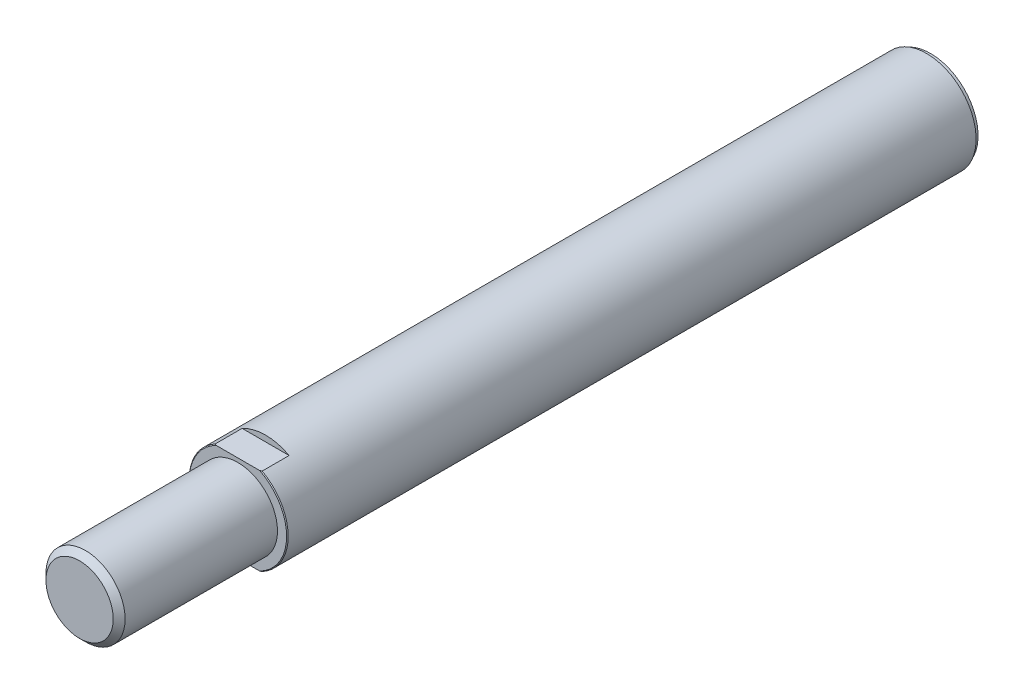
from build123d import *

# Parameters (mm, degrees)
ESBO_O1_R                       = 12.5
RESSALTO_EXTRUS_O1_DEPTH        = 215
ESBO_O2_OUTSIDE_W               = 70.578
ESBO_O2_OUTSIDE_H               = 70.578
ESBO_O2_OUTSIDE_R               = 10
CORTE_EXTRUS_O1_DEPTH           = 40
CHANFRO1_SIZE                   = 0.2
ESBO_O3_OUTSIDE_W               = 70.578
ESBO_O3_OUTSIDE_H               = 70.578
ESBO_O3_OUTSIDE_W_2             = 37.9352264
ESBO_O3_OUTSIDE_H_2             = 22
CORTE_EXTRUS_O2_DEPTH           = 7
CHANFRO2_SIZE                   = 1.5
ESBO_O4_OUTSIDE_W               = 70.578
ESBO_O4_OUTSIDE_H               = 70.578
ESBO_O4_OUTSIDE_R               = 12
CORTE_EXTRUS_O3_DEPTH           = 1
FURO_ROSCADO_DE_M12X1_751_D     = 10.2
FURO_ROSCADO_DE_M12X1_751_DEPTH = 32.75
FURO_ROSCADO_DE_M12X1_751_TIP   = 3.064389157


with BuildPart() as part:
    # Esbo_o1 → Ressalto-extrus_o1 (new body)
    with BuildSketch(Plane.XY):
        Circle(ESBO_O1_R)
    extrude(amount=RESSALTO_EXTRUS_O1_DEPTH)

    # Esbo_o2 outside → Corte-extrus_o1 (cut)
    with BuildSketch(Plane.XY.offset(215)):
        Rectangle(ESBO_O2_OUTSIDE_W, ESBO_O2_OUTSIDE_H)
        Circle(ESBO_O2_OUTSIDE_R, mode=Mode.SUBTRACT)
    extrude(amount=-CORTE_EXTRUS_O1_DEPTH, mode=Mode.SUBTRACT)

    # Chanfro1
    chanfro1_edges = [part.edges().sort_by_distance(p)[0] for p in [
        (-12.5, 0, 175),
    ]]
    chamfer(chanfro1_edges, length=CHANFRO1_SIZE)

    # Esbo_o3 outside → Corte-extrus_o2 (cut)
    with BuildSketch(Plane.XY.offset(175)):
        Rectangle(ESBO_O3_OUTSIDE_W, ESBO_O3_OUTSIDE_H)
        Rectangle(ESBO_O3_OUTSIDE_W_2, ESBO_O3_OUTSIDE_H_2, mode=Mode.SUBTRACT)
    extrude(amount=-CORTE_EXTRUS_O2_DEPTH, mode=Mode.SUBTRACT)

    # Chanfro2
    chanfro2_edges = [part.edges().sort_by_distance(p)[0] for p in [
        (-10, 0, 215),
    ]]
    chamfer(chanfro2_edges, length=CHANFRO2_SIZE)

    # Esbo_o4 outside → Corte-extrus_o3 (cut)
    with BuildSketch(Plane(origin=(0, 0, 0), x_dir=(-1, 0, 0), z_dir=(0, 0, -1))):
        Rectangle(ESBO_O4_OUTSIDE_W, ESBO_O4_OUTSIDE_H)
        Circle(ESBO_O4_OUTSIDE_R, mode=Mode.SUBTRACT)
    extrude(amount=-CORTE_EXTRUS_O3_DEPTH, mode=Mode.SUBTRACT)

    # Furo roscado de M12x1.751
    with Locations(Plane(origin=(0, 0, 0), x_dir=(-1, 0, 0), z_dir=(0, 0, -1))):
        with Locations((0, 0)):
            Hole(FURO_ROSCADO_DE_M12X1_751_D / 2, depth=FURO_ROSCADO_DE_M12X1_751_DEPTH)
            with Locations((0, 0, -(FURO_ROSCADO_DE_M12X1_751_DEPTH + FURO_ROSCADO_DE_M12X1_751_TIP / 2))):  # 118° drill point
                Cone(0, FURO_ROSCADO_DE_M12X1_751_D / 2, FURO_ROSCADO_DE_M12X1_751_TIP, mode=Mode.SUBTRACT)


solid = part.part
